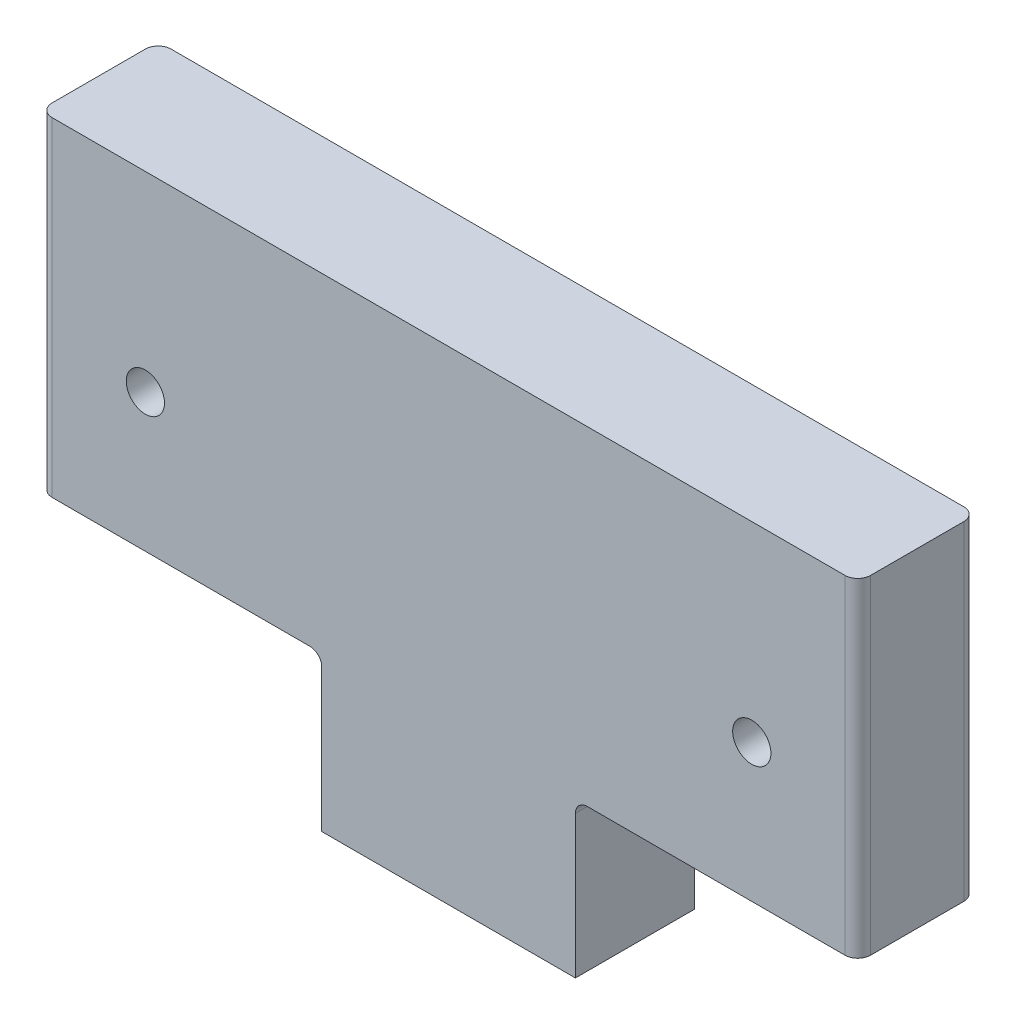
ISO-10303-21;
HEADER;
FILE_DESCRIPTION(('STEP AP214'),'2;1');
FILE_NAME('part.step','',(''),(''),'','','');
FILE_SCHEMA(('AUTOMOTIVE_DESIGN { 1 0 10303 214 1 1 1 1 }'));
ENDSEC;
DATA;
#1=APPLICATION_CONTEXT('core data for automotive mechanical design processes');
#2=APPLICATION_PROTOCOL_DEFINITION('international standard','automotive_design',2000,#1);
#3=PRODUCT_CONTEXT('',#1,'mechanical');
#4=PRODUCT('Part','Part','',(#3));
#5=PRODUCT_RELATED_PRODUCT_CATEGORY('part','',(#4));
#6=PRODUCT_DEFINITION_FORMATION('','',#4);
#7=PRODUCT_DEFINITION_CONTEXT('part definition',#1,'design');
#8=PRODUCT_DEFINITION('design','',#6,#7);
#9=PRODUCT_DEFINITION_SHAPE('','',#8);
#10=(LENGTH_UNIT() NAMED_UNIT(*) SI_UNIT(.MILLI.,.METRE.));
#11=(NAMED_UNIT(*) PLANE_ANGLE_UNIT() SI_UNIT($,.RADIAN.));
#12=(NAMED_UNIT(*) SI_UNIT($,.STERADIAN.) SOLID_ANGLE_UNIT());
#13=UNCERTAINTY_MEASURE_WITH_UNIT(LENGTH_MEASURE(1.E-05),#10,'distance_accuracy_value','');
#14=(GEOMETRIC_REPRESENTATION_CONTEXT(3) GLOBAL_UNCERTAINTY_ASSIGNED_CONTEXT((#13)) GLOBAL_UNIT_ASSIGNED_CONTEXT((#10,
#11,#12)) REPRESENTATION_CONTEXT('',''));
#15=CARTESIAN_POINT('',(0.,0.,0.));
#16=DIRECTION('',(0.,0.,1.));
#17=DIRECTION('',(1.,0.,0.));
#18=AXIS2_PLACEMENT_3D('',#15,#16,#17);
#19=CARTESIAN_POINT('',(-54.6608000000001,-21.971,7.9375));
#20=DIRECTION('',(0.,1.,0.));
#21=DIRECTION('',(0.,0.,1.));
#22=AXIS2_PLACEMENT_3D('',#19,#20,#21);
#23=PLANE('',#22);
#24=DIRECTION('',(1.,0.,0.));
#25=VECTOR('',#24,1.);
#26=CARTESIAN_POINT('',(-54.6608000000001,-21.971,7.9375));
#27=LINE('',#26,#25);
#28=CARTESIAN_POINT('',(18.5293000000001,-21.971,7.9375));
#29=VERTEX_POINT('',#28);
#30=CARTESIAN_POINT('',(52.9463000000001,-21.971,7.9375));
#31=VERTEX_POINT('',#30);
#32=EDGE_CURVE('E183',#29,#31,#27,.T.);
#33=ORIENTED_EDGE('',*,*,#32,.F.);
#34=DIRECTION('',(0.,0.,1.));
#35=VECTOR('',#34,1.);
#36=CARTESIAN_POINT('',(18.5293000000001,-21.971,7.9375));
#37=LINE('',#36,#35);
#38=CARTESIAN_POINT('',(18.5293000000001,-21.971,-7.9375));
#39=VERTEX_POINT('',#38);
#40=EDGE_CURVE('E58',#29,#39,#37,.F.);
#41=ORIENTED_EDGE('',*,*,#40,.T.);
#42=DIRECTION('',(1.,0.,0.));
#43=VECTOR('',#42,1.);
#44=CARTESIAN_POINT('',(-54.6608000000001,-21.971,-7.9375));
#45=LINE('',#44,#43);
#46=CARTESIAN_POINT('',(52.9463000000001,-21.971,-7.9375));
#47=VERTEX_POINT('',#46);
#48=EDGE_CURVE('E190',#39,#47,#45,.T.);
#49=ORIENTED_EDGE('',*,*,#48,.T.);
#50=CARTESIAN_POINT('',(52.9463000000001,-21.971,-6.223));
#51=DIRECTION('',(0.,1.,0.));
#52=DIRECTION('',(0.,0.,1.));
#53=AXIS2_PLACEMENT_3D('',#50,#51,#52);
#54=CIRCLE('',#53,1.7145);
#55=CARTESIAN_POINT('',(54.6608000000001,-21.971,-6.223));
#56=VERTEX_POINT('',#55);
#57=EDGE_CURVE('E240',#47,#56,#54,.F.);
#58=ORIENTED_EDGE('',*,*,#57,.T.);
#59=DIRECTION('',(0.,0.,-1.));
#60=VECTOR('',#59,1.);
#61=CARTESIAN_POINT('',(54.6608000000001,-21.971,7.9375));
#62=LINE('',#61,#60);
#63=CARTESIAN_POINT('',(54.6608000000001,-21.971,6.223));
#64=VERTEX_POINT('',#63);
#65=EDGE_CURVE('E187',#64,#56,#62,.T.);
#66=ORIENTED_EDGE('',*,*,#65,.F.);
#67=CARTESIAN_POINT('',(52.9463000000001,-21.971,6.223));
#68=DIRECTION('',(0.,1.,0.));
#69=DIRECTION('',(0.,0.,1.));
#70=AXIS2_PLACEMENT_3D('',#67,#68,#69);
#71=CIRCLE('',#70,1.7145);
#72=EDGE_CURVE('E237',#64,#31,#71,.F.);
#73=ORIENTED_EDGE('',*,*,#72,.T.);
#74=EDGE_LOOP('',(#33,#41,#49,#58,#66,#73));
#75=FACE_BOUND('',#74,.T.);
#76=ADVANCED_FACE('F37',(#75),#23,.F.);
#77=CARTESIAN_POINT('',(54.6608000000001,21.971,7.9375));
#78=DIRECTION('',(-1.,0.,0.));
#79=DIRECTION('',(0.,0.,1.));
#80=AXIS2_PLACEMENT_3D('',#77,#78,#79);
#81=PLANE('',#80);
#82=ORIENTED_EDGE('',*,*,#65,.T.);
#83=DIRECTION('',(0.,1.,0.));
#84=VECTOR('',#83,1.);
#85=CARTESIAN_POINT('',(54.6608000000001,21.971,-6.223));
#86=LINE('',#85,#84);
#87=CARTESIAN_POINT('',(54.6608000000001,21.971,-6.223));
#88=VERTEX_POINT('',#87);
#89=EDGE_CURVE('E234',#56,#88,#86,.T.);
#90=ORIENTED_EDGE('',*,*,#89,.T.);
#91=DIRECTION('',(0.,0.,-1.));
#92=VECTOR('',#91,1.);
#93=CARTESIAN_POINT('',(54.6608000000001,21.971,7.9375));
#94=LINE('',#93,#92);
#95=CARTESIAN_POINT('',(54.6608000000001,21.971,6.223));
#96=VERTEX_POINT('',#95);
#97=EDGE_CURVE('E201',#96,#88,#94,.T.);
#98=ORIENTED_EDGE('',*,*,#97,.F.);
#99=DIRECTION('',(0.,1.,0.));
#100=VECTOR('',#99,1.);
#101=CARTESIAN_POINT('',(54.6608000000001,-21.971,6.223));
#102=LINE('',#101,#100);
#103=EDGE_CURVE('E232',#96,#64,#102,.F.);
#104=ORIENTED_EDGE('',*,*,#103,.T.);
#105=EDGE_LOOP('',(#82,#90,#98,#104));
#106=FACE_BOUND('',#105,.T.);
#107=ADVANCED_FACE('F275',(#106),#81,.F.);
#108=CARTESIAN_POINT('',(-54.6608000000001,21.971,7.9375));
#109=DIRECTION('',(0.,-1.,0.));
#110=DIRECTION('',(0.,0.,-1.));
#111=AXIS2_PLACEMENT_3D('',#108,#109,#110);
#112=PLANE('',#111);
#113=DIRECTION('',(-1.,0.,0.));
#114=VECTOR('',#113,1.);
#115=CARTESIAN_POINT('',(-54.6608000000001,21.971,-7.9375));
#116=LINE('',#115,#114);
#117=CARTESIAN_POINT('',(52.9463000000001,21.971,-7.9375));
#118=VERTEX_POINT('',#117);
#119=CARTESIAN_POINT('',(-52.9463000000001,21.971,-7.9375));
#120=VERTEX_POINT('',#119);
#121=EDGE_CURVE('E180',#118,#120,#116,.T.);
#122=ORIENTED_EDGE('',*,*,#121,.T.);
#123=CARTESIAN_POINT('',(-52.9463000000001,21.971,-6.223));
#124=DIRECTION('',(0.,-1.,0.));
#125=DIRECTION('',(0.,0.,-1.));
#126=AXIS2_PLACEMENT_3D('',#123,#124,#125);
#127=CIRCLE('',#126,1.7145);
#128=CARTESIAN_POINT('',(-54.6608000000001,21.971,-6.223));
#129=VERTEX_POINT('',#128);
#130=EDGE_CURVE('E224',#120,#129,#127,.F.);
#131=ORIENTED_EDGE('',*,*,#130,.T.);
#132=DIRECTION('',(0.,0.,-1.));
#133=VECTOR('',#132,1.);
#134=CARTESIAN_POINT('',(-54.6608000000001,21.971,7.9375));
#135=LINE('',#134,#133);
#136=CARTESIAN_POINT('',(-54.6608000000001,21.971,6.223));
#137=VERTEX_POINT('',#136);
#138=EDGE_CURVE('E198',#137,#129,#135,.T.);
#139=ORIENTED_EDGE('',*,*,#138,.F.);
#140=CARTESIAN_POINT('',(-52.9463000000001,21.971,6.223));
#141=DIRECTION('',(0.,-1.,0.));
#142=DIRECTION('',(0.,0.,-1.));
#143=AXIS2_PLACEMENT_3D('',#140,#141,#142);
#144=CIRCLE('',#143,1.7145);
#145=CARTESIAN_POINT('',(-52.9463000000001,21.971,7.9375));
#146=VERTEX_POINT('',#145);
#147=EDGE_CURVE('E222',#137,#146,#144,.F.);
#148=ORIENTED_EDGE('',*,*,#147,.T.);
#149=DIRECTION('',(-1.,0.,0.));
#150=VECTOR('',#149,1.);
#151=CARTESIAN_POINT('',(-54.6608000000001,21.971,7.9375));
#152=LINE('',#151,#150);
#153=CARTESIAN_POINT('',(52.9463000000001,21.971,7.9375));
#154=VERTEX_POINT('',#153);
#155=EDGE_CURVE('E181',#154,#146,#152,.T.);
#156=ORIENTED_EDGE('',*,*,#155,.F.);
#157=CARTESIAN_POINT('',(52.9463000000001,21.971,6.223));
#158=DIRECTION('',(0.,-1.,0.));
#159=DIRECTION('',(0.,0.,-1.));
#160=AXIS2_PLACEMENT_3D('',#157,#158,#159);
#161=CIRCLE('',#160,1.7145);
#162=EDGE_CURVE('E218',#154,#96,#161,.F.);
#163=ORIENTED_EDGE('',*,*,#162,.T.);
#164=ORIENTED_EDGE('',*,*,#97,.T.);
#165=CARTESIAN_POINT('',(52.9463000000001,21.971,-6.223));
#166=DIRECTION('',(0.,-1.,0.));
#167=DIRECTION('',(0.,0.,-1.));
#168=AXIS2_PLACEMENT_3D('',#165,#166,#167);
#169=CIRCLE('',#168,1.7145);
#170=EDGE_CURVE('E220',#88,#118,#169,.F.);
#171=ORIENTED_EDGE('',*,*,#170,.T.);
#172=EDGE_LOOP('',(#122,#131,#139,#148,#156,#163,#164,#171));
#173=FACE_BOUND('',#172,.T.);
#174=ADVANCED_FACE('F280',(#173),#112,.F.);
#175=CARTESIAN_POINT('',(-54.6608000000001,21.971,7.9375));
#176=DIRECTION('',(1.,0.,0.));
#177=DIRECTION('',(0.,0.,-1.));
#178=AXIS2_PLACEMENT_3D('',#175,#176,#177);
#179=PLANE('',#178);
#180=ORIENTED_EDGE('',*,*,#138,.T.);
#181=DIRECTION('',(0.,-1.,0.));
#182=VECTOR('',#181,1.);
#183=CARTESIAN_POINT('',(-54.6608000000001,21.971,-6.223));
#184=LINE('',#183,#182);
#185=CARTESIAN_POINT('',(-54.6608000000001,-21.971,-6.223));
#186=VERTEX_POINT('',#185);
#187=EDGE_CURVE('E206',#129,#186,#184,.T.);
#188=ORIENTED_EDGE('',*,*,#187,.T.);
#189=DIRECTION('',(0.,0.,-1.));
#190=VECTOR('',#189,1.);
#191=CARTESIAN_POINT('',(-54.6608000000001,-21.971,7.9375));
#192=LINE('',#191,#190);
#193=CARTESIAN_POINT('',(-54.6608000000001,-21.971,6.223));
#194=VERTEX_POINT('',#193);
#195=EDGE_CURVE('E195',#194,#186,#192,.T.);
#196=ORIENTED_EDGE('',*,*,#195,.F.);
#197=DIRECTION('',(0.,-1.,0.));
#198=VECTOR('',#197,1.);
#199=CARTESIAN_POINT('',(-54.6608000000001,21.971,6.223));
#200=LINE('',#199,#198);
#201=EDGE_CURVE('E204',#194,#137,#200,.F.);
#202=ORIENTED_EDGE('',*,*,#201,.T.);
#203=EDGE_LOOP('',(#180,#188,#196,#202));
#204=FACE_BOUND('',#203,.T.);
#205=ADVANCED_FACE('F286',(#204),#179,.F.);
#206=CARTESIAN_POINT('',(-52.9463000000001,-21.971,-7.9375));
#207=VERTEX_POINT('',#206);
#208=CARTESIAN_POINT('',(-18.5293000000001,-21.971,-7.9375));
#209=VERTEX_POINT('',#208);
#210=EDGE_CURVE('E184',#207,#209,#45,.T.);
#211=ORIENTED_EDGE('',*,*,#210,.T.);
#212=DIRECTION('',(0.,0.,1.));
#213=VECTOR('',#212,1.);
#214=CARTESIAN_POINT('',(-18.5293000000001,-21.971,7.9375));
#215=LINE('',#214,#213);
#216=CARTESIAN_POINT('',(-18.5293000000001,-21.971,7.9375));
#217=VERTEX_POINT('',#216);
#218=EDGE_CURVE('E242',#209,#217,#215,.T.);
#219=ORIENTED_EDGE('',*,*,#218,.T.);
#220=CARTESIAN_POINT('',(-52.9463000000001,-21.971,7.9375));
#221=VERTEX_POINT('',#220);
#222=EDGE_CURVE('E185',#221,#217,#27,.T.);
#223=ORIENTED_EDGE('',*,*,#222,.F.);
#224=CARTESIAN_POINT('',(-52.9463000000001,-21.971,6.223));
#225=DIRECTION('',(0.,1.,0.));
#226=DIRECTION('',(0.,0.,1.));
#227=AXIS2_PLACEMENT_3D('',#224,#225,#226);
#228=CIRCLE('',#227,1.7145);
#229=EDGE_CURVE('E209',#221,#194,#228,.F.);
#230=ORIENTED_EDGE('',*,*,#229,.T.);
#231=ORIENTED_EDGE('',*,*,#195,.T.);
#232=CARTESIAN_POINT('',(-52.9463000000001,-21.971,-6.223));
#233=DIRECTION('',(0.,1.,0.));
#234=DIRECTION('',(0.,0.,1.));
#235=AXIS2_PLACEMENT_3D('',#232,#233,#234);
#236=CIRCLE('',#235,1.7145);
#237=EDGE_CURVE('E211',#186,#207,#236,.F.);
#238=ORIENTED_EDGE('',*,*,#237,.T.);
#239=EDGE_LOOP('',(#211,#219,#223,#230,#231,#238));
#240=FACE_BOUND('',#239,.T.);
#241=ADVANCED_FACE('F261',(#240),#23,.F.);
#242=CARTESIAN_POINT('',(0.,0.,7.9375));
#243=DIRECTION('',(0.,0.,1.));
#244=DIRECTION('',(1.,0.,0.));
#245=AXIS2_PLACEMENT_3D('',#242,#243,#244);
#246=PLANE('',#245);
#247=CARTESIAN_POINT('',(-40.5003000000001,-3.55599999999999,7.9375));
#248=DIRECTION('',(0.,0.,1.));
#249=DIRECTION('',(1.,0.,0.));
#250=AXIS2_PLACEMENT_3D('',#247,#248,#249);
#251=CIRCLE('',#250,2.5527);
#252=CARTESIAN_POINT('',(-37.9476000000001,-3.55599999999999,7.9375));
#253=VERTEX_POINT('',#252);
#254=EDGE_CURVE('E168',#253,#253,#251,.T.);
#255=ORIENTED_EDGE('',*,*,#254,.F.);
#256=EDGE_LOOP('',(#255));
#257=FACE_BOUND('',#256,.T.);
#258=CARTESIAN_POINT('',(40.5003000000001,-3.55599999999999,7.9375));
#259=DIRECTION('',(0.,0.,1.));
#260=DIRECTION('',(1.,0.,0.));
#261=AXIS2_PLACEMENT_3D('',#258,#259,#260);
#262=CIRCLE('',#261,2.5527);
#263=CARTESIAN_POINT('',(43.0530000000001,-3.55599999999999,7.9375));
#264=VERTEX_POINT('',#263);
#265=EDGE_CURVE('E174',#264,#264,#262,.T.);
#266=ORIENTED_EDGE('',*,*,#265,.F.);
#267=EDGE_LOOP('',(#266));
#268=FACE_BOUND('',#267,.T.);
#269=ORIENTED_EDGE('',*,*,#155,.T.);
#270=DIRECTION('',(0.,-1.,0.));
#271=VECTOR('',#270,1.);
#272=CARTESIAN_POINT('',(-52.9463000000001,-21.971,7.9375));
#273=LINE('',#272,#271);
#274=EDGE_CURVE('E229',#146,#221,#273,.T.);
#275=ORIENTED_EDGE('',*,*,#274,.T.);
#276=ORIENTED_EDGE('',*,*,#222,.T.);
#277=CARTESIAN_POINT('',(-18.5293000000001,-23.5585,7.9375));
#278=DIRECTION('',(0.,0.,1.));
#279=DIRECTION('',(1.,0.,0.));
#280=AXIS2_PLACEMENT_3D('',#277,#278,#279);
#281=CIRCLE('',#280,1.5875);
#282=CARTESIAN_POINT('',(-16.9418000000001,-23.5585,7.9375));
#283=VERTEX_POINT('',#282);
#284=EDGE_CURVE('E142',#217,#283,#281,.F.);
#285=ORIENTED_EDGE('',*,*,#284,.T.);
#286=DIRECTION('',(0.,-1.,0.));
#287=VECTOR('',#286,1.);
#288=CARTESIAN_POINT('',(-16.9418000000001,-21.971,7.9375));
#289=LINE('',#288,#287);
#290=CARTESIAN_POINT('',(-16.9418000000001,-42.6085,7.9375));
#291=VERTEX_POINT('',#290);
#292=EDGE_CURVE('E135',#283,#291,#289,.T.);
#293=ORIENTED_EDGE('',*,*,#292,.T.);
#294=DIRECTION('',(1.,0.,0.));
#295=VECTOR('',#294,1.);
#296=CARTESIAN_POINT('',(-16.9418000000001,-42.6085,7.9375));
#297=LINE('',#296,#295);
#298=CARTESIAN_POINT('',(16.9418000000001,-42.6085,7.9375));
#299=VERTEX_POINT('',#298);
#300=EDGE_CURVE('E140',#291,#299,#297,.T.);
#301=ORIENTED_EDGE('',*,*,#300,.T.);
#302=DIRECTION('',(0.,1.,0.));
#303=VECTOR('',#302,1.);
#304=CARTESIAN_POINT('',(16.9418000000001,-21.971,7.9375));
#305=LINE('',#304,#303);
#306=CARTESIAN_POINT('',(16.9418000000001,-23.5585,7.9375));
#307=VERTEX_POINT('',#306);
#308=EDGE_CURVE('E155',#299,#307,#305,.T.);
#309=ORIENTED_EDGE('',*,*,#308,.T.);
#310=CARTESIAN_POINT('',(18.5293000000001,-23.5585,7.9375));
#311=DIRECTION('',(0.,0.,1.));
#312=DIRECTION('',(1.,0.,0.));
#313=AXIS2_PLACEMENT_3D('',#310,#311,#312);
#314=CIRCLE('',#313,1.5875);
#315=EDGE_CURVE('E45',#307,#29,#314,.F.);
#316=ORIENTED_EDGE('',*,*,#315,.T.);
#317=ORIENTED_EDGE('',*,*,#32,.T.);
#318=DIRECTION('',(0.,1.,0.));
#319=VECTOR('',#318,1.);
#320=CARTESIAN_POINT('',(52.9463000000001,21.971,7.9375));
#321=LINE('',#320,#319);
#322=EDGE_CURVE('E226',#31,#154,#321,.T.);
#323=ORIENTED_EDGE('',*,*,#322,.T.);
#324=EDGE_LOOP('',(#269,#275,#276,#285,#293,#301,#309,#316,#317,#323));
#325=FACE_BOUND('',#324,.T.);
#326=ADVANCED_FACE('F138',(#257,#268,#325),#246,.T.);
#327=CARTESIAN_POINT('',(0.,0.,-7.9375));
#328=DIRECTION('',(0.,0.,1.));
#329=DIRECTION('',(1.,0.,0.));
#330=AXIS2_PLACEMENT_3D('',#327,#328,#329);
#331=PLANE('',#330);
#332=CARTESIAN_POINT('',(-40.5003000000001,-3.55599999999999,-7.9375));
#333=DIRECTION('',(0.,0.,1.));
#334=DIRECTION('',(1.,0.,0.));
#335=AXIS2_PLACEMENT_3D('',#332,#333,#334);
#336=CIRCLE('',#335,2.5527);
#337=CARTESIAN_POINT('',(-37.9476000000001,-3.55599999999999,-7.9375));
#338=VERTEX_POINT('',#337);
#339=EDGE_CURVE('E171',#338,#338,#336,.T.);
#340=ORIENTED_EDGE('',*,*,#339,.T.);
#341=EDGE_LOOP('',(#340));
#342=FACE_BOUND('',#341,.T.);
#343=CARTESIAN_POINT('',(40.5003000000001,-3.55599999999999,-7.9375));
#344=DIRECTION('',(0.,0.,1.));
#345=DIRECTION('',(1.,0.,0.));
#346=AXIS2_PLACEMENT_3D('',#343,#344,#345);
#347=CIRCLE('',#346,2.5527);
#348=CARTESIAN_POINT('',(43.0530000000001,-3.55599999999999,-7.9375));
#349=VERTEX_POINT('',#348);
#350=EDGE_CURVE('E177',#349,#349,#347,.T.);
#351=ORIENTED_EDGE('',*,*,#350,.T.);
#352=EDGE_LOOP('',(#351));
#353=FACE_BOUND('',#352,.T.);
#354=ORIENTED_EDGE('',*,*,#210,.F.);
#355=DIRECTION('',(0.,-1.,0.));
#356=VECTOR('',#355,1.);
#357=CARTESIAN_POINT('',(-52.9463000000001,0.,-7.9375));
#358=LINE('',#357,#356);
#359=EDGE_CURVE('E216',#207,#120,#358,.F.);
#360=ORIENTED_EDGE('',*,*,#359,.T.);
#361=ORIENTED_EDGE('',*,*,#121,.F.);
#362=DIRECTION('',(0.,1.,0.));
#363=VECTOR('',#362,1.);
#364=CARTESIAN_POINT('',(52.9463000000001,0.,-7.9375));
#365=LINE('',#364,#363);
#366=EDGE_CURVE('E213',#118,#47,#365,.F.);
#367=ORIENTED_EDGE('',*,*,#366,.T.);
#368=ORIENTED_EDGE('',*,*,#48,.F.);
#369=CARTESIAN_POINT('',(18.5293000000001,-23.5585,-7.9375));
#370=DIRECTION('',(0.,0.,1.));
#371=DIRECTION('',(1.,0.,0.));
#372=AXIS2_PLACEMENT_3D('',#369,#370,#371);
#373=CIRCLE('',#372,1.5875);
#374=CARTESIAN_POINT('',(16.9418000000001,-23.5585,-7.9375));
#375=VERTEX_POINT('',#374);
#376=EDGE_CURVE('E11',#39,#375,#373,.T.);
#377=ORIENTED_EDGE('',*,*,#376,.T.);
#378=DIRECTION('',(0.,-1.,0.));
#379=VECTOR('',#378,1.);
#380=CARTESIAN_POINT('',(16.9418000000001,-21.971,-7.9375));
#381=LINE('',#380,#379);
#382=CARTESIAN_POINT('',(16.9418000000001,-42.6085,-7.9375));
#383=VERTEX_POINT('',#382);
#384=EDGE_CURVE('E164',#375,#383,#381,.T.);
#385=ORIENTED_EDGE('',*,*,#384,.T.);
#386=DIRECTION('',(-1.,0.,0.));
#387=VECTOR('',#386,1.);
#388=CARTESIAN_POINT('',(-16.9418000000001,-42.6085,-7.9375));
#389=LINE('',#388,#387);
#390=CARTESIAN_POINT('',(-16.9418000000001,-42.6085,-7.9375));
#391=VERTEX_POINT('',#390);
#392=EDGE_CURVE('E166',#383,#391,#389,.T.);
#393=ORIENTED_EDGE('',*,*,#392,.T.);
#394=DIRECTION('',(0.,1.,0.));
#395=VECTOR('',#394,1.);
#396=CARTESIAN_POINT('',(-16.9418000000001,-21.971,-7.9375));
#397=LINE('',#396,#395);
#398=CARTESIAN_POINT('',(-16.9418000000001,-23.5585,-7.9375));
#399=VERTEX_POINT('',#398);
#400=EDGE_CURVE('E151',#391,#399,#397,.T.);
#401=ORIENTED_EDGE('',*,*,#400,.T.);
#402=CARTESIAN_POINT('',(-18.5293000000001,-23.5585,-7.9375));
#403=DIRECTION('',(0.,0.,1.));
#404=DIRECTION('',(1.,0.,0.));
#405=AXIS2_PLACEMENT_3D('',#402,#403,#404);
#406=CIRCLE('',#405,1.5875);
#407=EDGE_CURVE('E252',#399,#209,#406,.T.);
#408=ORIENTED_EDGE('',*,*,#407,.T.);
#409=EDGE_LOOP('',(#354,#360,#361,#367,#368,#377,#385,#393,#401,#408));
#410=FACE_BOUND('',#409,.T.);
#411=ADVANCED_FACE('F256',(#342,#353,#410),#331,.F.);
#412=CARTESIAN_POINT('',(40.5003000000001,-3.55599999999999,7.9375));
#413=DIRECTION('',(0.,0.,1.));
#414=DIRECTION('',(1.,0.,0.));
#415=AXIS2_PLACEMENT_3D('',#412,#413,#414);
#416=CYLINDRICAL_SURFACE('',#415,2.5527);
#417=ORIENTED_EDGE('',*,*,#350,.F.);
#418=EDGE_LOOP('',(#417));
#419=FACE_BOUND('',#418,.T.);
#420=ORIENTED_EDGE('',*,*,#265,.T.);
#421=EDGE_LOOP('',(#420));
#422=FACE_BOUND('',#421,.T.);
#423=ADVANCED_FACE('F338',(#419,#422),#416,.F.);
#424=CARTESIAN_POINT('',(-40.5003000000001,-3.55599999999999,7.9375));
#425=DIRECTION('',(0.,0.,1.));
#426=DIRECTION('',(1.,0.,0.));
#427=AXIS2_PLACEMENT_3D('',#424,#425,#426);
#428=CYLINDRICAL_SURFACE('',#427,2.5527);
#429=ORIENTED_EDGE('',*,*,#339,.F.);
#430=EDGE_LOOP('',(#429));
#431=FACE_BOUND('',#430,.T.);
#432=ORIENTED_EDGE('',*,*,#254,.T.);
#433=EDGE_LOOP('',(#432));
#434=FACE_BOUND('',#433,.T.);
#435=ADVANCED_FACE('F333',(#431,#434),#428,.F.);
#436=CARTESIAN_POINT('',(-16.9418000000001,-21.971,-47.6112287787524));
#437=DIRECTION('',(-1.,0.,0.));
#438=DIRECTION('',(0.,-1.,0.));
#439=AXIS2_PLACEMENT_3D('',#436,#437,#438);
#440=PLANE('',#439);
#441=ORIENTED_EDGE('',*,*,#292,.F.);
#442=DIRECTION('',(0.,0.,1.));
#443=VECTOR('',#442,1.);
#444=CARTESIAN_POINT('',(-16.9418000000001,-23.5585,-47.6112287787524));
#445=LINE('',#444,#443);
#446=EDGE_CURVE('E245',#283,#399,#445,.F.);
#447=ORIENTED_EDGE('',*,*,#446,.T.);
#448=ORIENTED_EDGE('',*,*,#400,.F.);
#449=DIRECTION('',(0.,0.,1.));
#450=VECTOR('',#449,1.);
#451=CARTESIAN_POINT('',(-16.9418000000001,-42.6085,-47.6112287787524));
#452=LINE('',#451,#450);
#453=EDGE_CURVE('E148',#391,#291,#452,.T.);
#454=ORIENTED_EDGE('',*,*,#453,.T.);
#455=EDGE_LOOP('',(#441,#447,#448,#454));
#456=FACE_BOUND('',#455,.T.);
#457=ADVANCED_FACE('F149',(#456),#440,.T.);
#458=CARTESIAN_POINT('',(16.9418000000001,-21.971,-47.6112287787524));
#459=DIRECTION('',(1.,0.,0.));
#460=DIRECTION('',(0.,1.,0.));
#461=AXIS2_PLACEMENT_3D('',#458,#459,#460);
#462=PLANE('',#461);
#463=ORIENTED_EDGE('',*,*,#384,.F.);
#464=DIRECTION('',(0.,0.,1.));
#465=VECTOR('',#464,1.);
#466=CARTESIAN_POINT('',(16.9418000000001,-23.5585,-47.6112287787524));
#467=LINE('',#466,#465);
#468=EDGE_CURVE('E247',#375,#307,#467,.T.);
#469=ORIENTED_EDGE('',*,*,#468,.T.);
#470=ORIENTED_EDGE('',*,*,#308,.F.);
#471=DIRECTION('',(0.,0.,1.));
#472=VECTOR('',#471,1.);
#473=CARTESIAN_POINT('',(16.9418000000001,-42.6085,-47.6112287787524));
#474=LINE('',#473,#472);
#475=EDGE_CURVE('E154',#383,#299,#474,.T.);
#476=ORIENTED_EDGE('',*,*,#475,.F.);
#477=EDGE_LOOP('',(#463,#469,#470,#476));
#478=FACE_BOUND('',#477,.T.);
#479=ADVANCED_FACE('F324',(#478),#462,.T.);
#480=CARTESIAN_POINT('',(-16.9418000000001,-42.6085,-47.6112287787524));
#481=DIRECTION('',(0.,-1.,0.));
#482=DIRECTION('',(0.,0.,-1.));
#483=AXIS2_PLACEMENT_3D('',#480,#481,#482);
#484=PLANE('',#483);
#485=ORIENTED_EDGE('',*,*,#392,.F.);
#486=ORIENTED_EDGE('',*,*,#475,.T.);
#487=ORIENTED_EDGE('',*,*,#300,.F.);
#488=ORIENTED_EDGE('',*,*,#453,.F.);
#489=EDGE_LOOP('',(#485,#486,#487,#488));
#490=FACE_BOUND('',#489,.T.);
#491=ADVANCED_FACE('F157',(#490),#484,.T.);
#492=CARTESIAN_POINT('',(-52.9463000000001,21.971,-6.223));
#493=DIRECTION('',(0.,-1.,0.));
#494=DIRECTION('',(0.,0.,-1.));
#495=AXIS2_PLACEMENT_3D('',#492,#493,#494);
#496=CYLINDRICAL_SURFACE('',#495,1.7145);
#497=ORIENTED_EDGE('',*,*,#130,.F.);
#498=ORIENTED_EDGE('',*,*,#359,.F.);
#499=ORIENTED_EDGE('',*,*,#237,.F.);
#500=ORIENTED_EDGE('',*,*,#187,.F.);
#501=EDGE_LOOP('',(#497,#498,#499,#500));
#502=FACE_BOUND('',#501,.T.);
#503=ADVANCED_FACE('F300',(#502),#496,.T.);
#504=CARTESIAN_POINT('',(-52.9463000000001,0.,6.223));
#505=DIRECTION('',(0.,1.,0.));
#506=DIRECTION('',(0.,0.,1.));
#507=AXIS2_PLACEMENT_3D('',#504,#505,#506);
#508=CYLINDRICAL_SURFACE('',#507,1.7145);
#509=ORIENTED_EDGE('',*,*,#147,.F.);
#510=ORIENTED_EDGE('',*,*,#201,.F.);
#511=ORIENTED_EDGE('',*,*,#229,.F.);
#512=ORIENTED_EDGE('',*,*,#274,.F.);
#513=EDGE_LOOP('',(#509,#510,#511,#512));
#514=FACE_BOUND('',#513,.T.);
#515=ADVANCED_FACE('F303',(#514),#508,.T.);
#516=CARTESIAN_POINT('',(52.9463000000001,21.971,-6.223));
#517=DIRECTION('',(0.,1.,0.));
#518=DIRECTION('',(0.,0.,1.));
#519=AXIS2_PLACEMENT_3D('',#516,#517,#518);
#520=CYLINDRICAL_SURFACE('',#519,1.7145);
#521=ORIENTED_EDGE('',*,*,#57,.F.);
#522=ORIENTED_EDGE('',*,*,#366,.F.);
#523=ORIENTED_EDGE('',*,*,#170,.F.);
#524=ORIENTED_EDGE('',*,*,#89,.F.);
#525=EDGE_LOOP('',(#521,#522,#523,#524));
#526=FACE_BOUND('',#525,.T.);
#527=ADVANCED_FACE('F271',(#526),#520,.T.);
#528=CARTESIAN_POINT('',(52.9463000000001,0.,6.223));
#529=DIRECTION('',(0.,-1.,0.));
#530=DIRECTION('',(0.,0.,-1.));
#531=AXIS2_PLACEMENT_3D('',#528,#529,#530);
#532=CYLINDRICAL_SURFACE('',#531,1.7145);
#533=ORIENTED_EDGE('',*,*,#72,.F.);
#534=ORIENTED_EDGE('',*,*,#103,.F.);
#535=ORIENTED_EDGE('',*,*,#162,.F.);
#536=ORIENTED_EDGE('',*,*,#322,.F.);
#537=EDGE_LOOP('',(#533,#534,#535,#536));
#538=FACE_BOUND('',#537,.T.);
#539=ADVANCED_FACE('F265',(#538),#532,.T.);
#540=CARTESIAN_POINT('',(-18.5293000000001,-23.5585,7.9375));
#541=DIRECTION('',(0.,0.,1.));
#542=DIRECTION('',(1.,0.,0.));
#543=AXIS2_PLACEMENT_3D('',#540,#541,#542);
#544=CYLINDRICAL_SURFACE('',#543,1.5875);
#545=ORIENTED_EDGE('',*,*,#407,.F.);
#546=ORIENTED_EDGE('',*,*,#446,.F.);
#547=ORIENTED_EDGE('',*,*,#284,.F.);
#548=ORIENTED_EDGE('',*,*,#218,.F.);
#549=EDGE_LOOP('',(#545,#546,#547,#548));
#550=FACE_BOUND('',#549,.T.);
#551=ADVANCED_FACE('F263',(#550),#544,.F.);
#552=CARTESIAN_POINT('',(18.5293000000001,-23.5585,-47.6112287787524));
#553=DIRECTION('',(0.,0.,1.));
#554=DIRECTION('',(1.,0.,0.));
#555=AXIS2_PLACEMENT_3D('',#552,#553,#554);
#556=CYLINDRICAL_SURFACE('',#555,1.5875);
#557=ORIENTED_EDGE('',*,*,#376,.F.);
#558=ORIENTED_EDGE('',*,*,#40,.F.);
#559=ORIENTED_EDGE('',*,*,#315,.F.);
#560=ORIENTED_EDGE('',*,*,#468,.F.);
#561=EDGE_LOOP('',(#557,#558,#559,#560));
#562=FACE_BOUND('',#561,.T.);
#563=ADVANCED_FACE('F39',(#562),#556,.F.);
#564=CLOSED_SHELL('',(#76,#107,#174,#205,#241,#326,#411,#423,#435,#457,#479,#491,#503,#515,#527,
#539,#551,#563));
#565=MANIFOLD_SOLID_BREP('B2',#564);
#566=ADVANCED_BREP_SHAPE_REPRESENTATION('',(#18,#565),#14);
#567=SHAPE_DEFINITION_REPRESENTATION(#9,#566);
ENDSEC;
END-ISO-10303-21;
